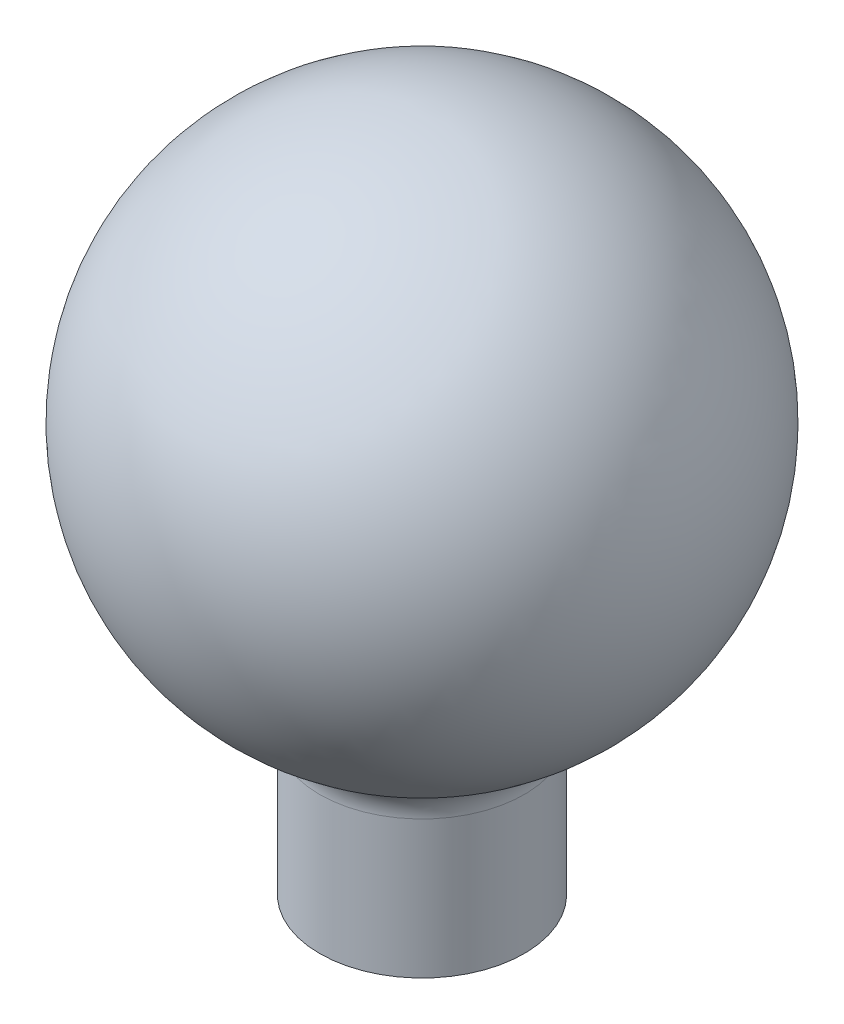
ISO-10303-21;
HEADER;
FILE_DESCRIPTION(('STEP AP214'),'2;1');
FILE_NAME('part.step','',(''),(''),'','','');
FILE_SCHEMA(('AUTOMOTIVE_DESIGN { 1 0 10303 214 1 1 1 1 }'));
ENDSEC;
DATA;
#1=APPLICATION_CONTEXT('core data for automotive mechanical design processes');
#2=APPLICATION_PROTOCOL_DEFINITION('international standard','automotive_design',2000,#1);
#3=PRODUCT_CONTEXT('',#1,'mechanical');
#4=PRODUCT('Part','Part','',(#3));
#5=PRODUCT_RELATED_PRODUCT_CATEGORY('part','',(#4));
#6=PRODUCT_DEFINITION_FORMATION('','',#4);
#7=PRODUCT_DEFINITION_CONTEXT('part definition',#1,'design');
#8=PRODUCT_DEFINITION('design','',#6,#7);
#9=PRODUCT_DEFINITION_SHAPE('','',#8);
#10=(LENGTH_UNIT() NAMED_UNIT(*) SI_UNIT(.MILLI.,.METRE.));
#11=(NAMED_UNIT(*) PLANE_ANGLE_UNIT() SI_UNIT($,.RADIAN.));
#12=(NAMED_UNIT(*) SI_UNIT($,.STERADIAN.) SOLID_ANGLE_UNIT());
#13=UNCERTAINTY_MEASURE_WITH_UNIT(LENGTH_MEASURE(1.E-05),#10,'distance_accuracy_value','');
#14=(GEOMETRIC_REPRESENTATION_CONTEXT(3) GLOBAL_UNCERTAINTY_ASSIGNED_CONTEXT((#13)) GLOBAL_UNIT_ASSIGNED_CONTEXT((#10,
#11,#12)) REPRESENTATION_CONTEXT('',''));
#15=CARTESIAN_POINT('',(0.,0.,0.));
#16=DIRECTION('',(0.,0.,1.));
#17=DIRECTION('',(1.,0.,0.));
#18=AXIS2_PLACEMENT_3D('',#15,#16,#17);
#19=CARTESIAN_POINT('',(0.,0.,0.));
#20=DIRECTION('',(0.,1.,0.));
#21=DIRECTION('',(0.,0.,1.));
#22=AXIS2_PLACEMENT_3D('',#19,#20,#21);
#23=PLANE('',#22);
#24=CARTESIAN_POINT('',(0.,0.,0.));
#25=DIRECTION('',(0.,1.,0.));
#26=DIRECTION('',(0.,0.,1.));
#27=AXIS2_PLACEMENT_3D('',#24,#25,#26);
#28=CIRCLE('',#27,12.5);
#29=CARTESIAN_POINT('',(0.,0.,12.5));
#30=VERTEX_POINT('',#29);
#31=EDGE_CURVE('E71',#30,#30,#28,.T.);
#32=ORIENTED_EDGE('',*,*,#31,.F.);
#33=EDGE_LOOP('',(#32));
#34=FACE_BOUND('',#33,.T.);
#35=CARTESIAN_POINT('',(0.,0.,0.));
#36=DIRECTION('',(0.,1.,0.));
#37=DIRECTION('',(0.,0.,1.));
#38=AXIS2_PLACEMENT_3D('',#35,#36,#37);
#39=CIRCLE('',#38,7.5);
#40=CARTESIAN_POINT('',(4.5,0.,-6.));
#41=VERTEX_POINT('',#40);
#42=CARTESIAN_POINT('',(4.5,0.,6.));
#43=VERTEX_POINT('',#42);
#44=EDGE_CURVE('E48',#41,#43,#39,.T.);
#45=ORIENTED_EDGE('',*,*,#44,.T.);
#46=DIRECTION('',(0.,0.,-1.));
#47=VECTOR('',#46,1.);
#48=CARTESIAN_POINT('',(4.5,0.,-6.));
#49=LINE('',#48,#47);
#50=EDGE_CURVE('E70',#43,#41,#49,.T.);
#51=ORIENTED_EDGE('',*,*,#50,.T.);
#52=EDGE_LOOP('',(#45,#51));
#53=FACE_BOUND('',#52,.T.);
#54=ADVANCED_FACE('F33',(#34,#53),#23,.F.);
#55=CARTESIAN_POINT('',(0.,20.,0.));
#56=DIRECTION('',(0.,-1.,0.));
#57=DIRECTION('',(0.,0.,-1.));
#58=AXIS2_PLACEMENT_3D('',#55,#56,#57);
#59=CYLINDRICAL_SURFACE('',#58,12.5);
#60=CARTESIAN_POINT('',(0.,16.833752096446,0.));
#61=DIRECTION('',(0.,1.,0.));
#62=DIRECTION('',(0.,0.,1.));
#63=AXIS2_PLACEMENT_3D('',#60,#61,#62);
#64=CIRCLE('',#63,12.5);
#65=CARTESIAN_POINT('',(0.,16.833752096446,12.5));
#66=VERTEX_POINT('',#65);
#67=EDGE_CURVE('E11',#66,#66,#64,.F.);
#68=ORIENTED_EDGE('',*,*,#67,.T.);
#69=EDGE_LOOP('',(#68));
#70=FACE_BOUND('',#69,.T.);
#71=ORIENTED_EDGE('',*,*,#31,.T.);
#72=EDGE_LOOP('',(#71));
#73=FACE_BOUND('',#72,.T.);
#74=ADVANCED_FACE('F35',(#70,#73),#59,.T.);
#75=CARTESIAN_POINT('',(0.,20.,0.));
#76=DIRECTION('',(0.,-1.,0.));
#77=DIRECTION('',(0.,0.,-1.));
#78=AXIS2_PLACEMENT_3D('',#75,#76,#77);
#79=CYLINDRICAL_SURFACE('',#78,7.5);
#80=ORIENTED_EDGE('',*,*,#44,.F.);
#81=DIRECTION('',(0.,-1.,0.));
#82=VECTOR('',#81,1.);
#83=CARTESIAN_POINT('',(4.5,20.,-6.));
#84=LINE('',#83,#82);
#85=CARTESIAN_POINT('',(4.5,20.,-6.));
#86=VERTEX_POINT('',#85);
#87=EDGE_CURVE('E65',#86,#41,#84,.T.);
#88=ORIENTED_EDGE('',*,*,#87,.F.);
#89=CARTESIAN_POINT('',(0.,20.,0.));
#90=DIRECTION('',(0.,1.,0.));
#91=DIRECTION('',(0.,0.,1.));
#92=AXIS2_PLACEMENT_3D('',#89,#90,#91);
#93=CIRCLE('',#92,7.5);
#94=CARTESIAN_POINT('',(4.5,20.,6.));
#95=VERTEX_POINT('',#94);
#96=EDGE_CURVE('E55',#86,#95,#93,.T.);
#97=ORIENTED_EDGE('',*,*,#96,.T.);
#98=DIRECTION('',(0.,-1.,0.));
#99=VECTOR('',#98,1.);
#100=CARTESIAN_POINT('',(4.5,20.,6.));
#101=LINE('',#100,#99);
#102=EDGE_CURVE('E67',#95,#43,#101,.T.);
#103=ORIENTED_EDGE('',*,*,#102,.T.);
#104=EDGE_LOOP('',(#80,#88,#97,#103));
#105=FACE_BOUND('',#104,.T.);
#106=ADVANCED_FACE('F73',(#105),#79,.F.);
#107=CARTESIAN_POINT('',(4.5,20.,-6.));
#108=DIRECTION('',(-1.,0.,0.));
#109=DIRECTION('',(0.,0.,1.));
#110=AXIS2_PLACEMENT_3D('',#107,#108,#109);
#111=PLANE('',#110);
#112=ORIENTED_EDGE('',*,*,#50,.F.);
#113=ORIENTED_EDGE('',*,*,#102,.F.);
#114=DIRECTION('',(0.,0.,-1.));
#115=VECTOR('',#114,1.);
#116=CARTESIAN_POINT('',(4.5,20.,-6.));
#117=LINE('',#116,#115);
#118=EDGE_CURVE('E61',#95,#86,#117,.T.);
#119=ORIENTED_EDGE('',*,*,#118,.T.);
#120=ORIENTED_EDGE('',*,*,#87,.T.);
#121=EDGE_LOOP('',(#112,#113,#119,#120));
#122=FACE_BOUND('',#121,.T.);
#123=ADVANCED_FACE('F68',(#122),#111,.T.);
#124=CARTESIAN_POINT('',(12.5,20.,0.));
#125=DIRECTION('',(0.,-1.,0.));
#126=DIRECTION('',(1.,0.,0.));
#127=AXIS2_PLACEMENT_3D('',#124,#125,#126);
#128=PLANE('',#127);
#129=ORIENTED_EDGE('',*,*,#118,.F.);
#130=ORIENTED_EDGE('',*,*,#96,.F.);
#131=EDGE_LOOP('',(#129,#130));
#132=FACE_BOUND('',#131,.T.);
#133=ADVANCED_FACE('F63',(#132),#128,.T.);
#134=CARTESIAN_POINT('',(0.,50.,0.));
#135=DIRECTION('',(0.,-1.,0.));
#136=DIRECTION('',(1.,0.,0.));
#137=AXIS2_PLACEMENT_3D('',#134,#135,#136);
#138=SPHERICAL_SURFACE('',#137,32.5);
#139=CARTESIAN_POINT('',(0.,21.2559184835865,0.));
#140=DIRECTION('',(0.,1.,0.));
#141=DIRECTION('',(0.,0.,1.));
#142=AXIS2_PLACEMENT_3D('',#139,#140,#141);
#143=CIRCLE('',#142,15.1666666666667);
#144=CARTESIAN_POINT('',(0.,21.2559184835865,15.1666666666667));
#145=VERTEX_POINT('',#144);
#146=EDGE_CURVE('E41',#145,#145,#143,.T.);
#147=ORIENTED_EDGE('',*,*,#146,.T.);
#148=EDGE_LOOP('',(#147));
#149=FACE_BOUND('',#148,.T.);
#150=ADVANCED_FACE('F83',(#149),#138,.T.);
#151=CARTESIAN_POINT('',(0.,16.833752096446,0.));
#152=DIRECTION('',(0.,1.,0.));
#153=DIRECTION('',(0.,0.,1.));
#154=AXIS2_PLACEMENT_3D('',#151,#152,#153);
#155=TOROIDAL_SURFACE('',#154,17.5,5.);
#156=ORIENTED_EDGE('',*,*,#67,.F.);
#157=EDGE_LOOP('',(#156));
#158=FACE_BOUND('',#157,.T.);
#159=ORIENTED_EDGE('',*,*,#146,.F.);
#160=EDGE_LOOP('',(#159));
#161=FACE_BOUND('',#160,.T.);
#162=ADVANCED_FACE('F85',(#158,#161),#155,.F.);
#163=CLOSED_SHELL('',(#54,#74,#106,#123,#133,#150,#162));
#164=MANIFOLD_SOLID_BREP('B2',#163);
#165=ADVANCED_BREP_SHAPE_REPRESENTATION('',(#18,#164),#14);
#166=SHAPE_DEFINITION_REPRESENTATION(#9,#165);
ENDSEC;
END-ISO-10303-21;
